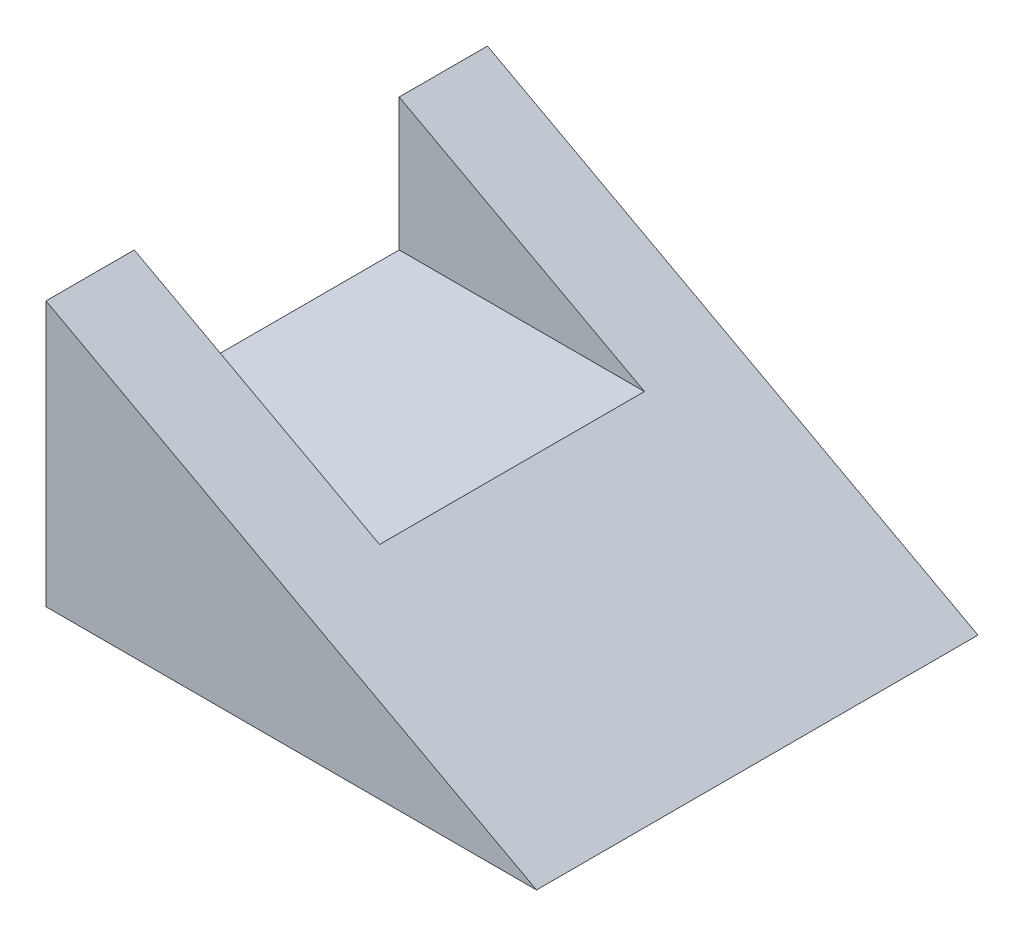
from build123d import *

# Parameters (mm, degrees)
EXTRUSION1_DEPTH        = 45
ESQUISSE2_W             = 27
ESQUISSE2_H             = 15.357142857
ENL_V_MAT_EXTRU_1_DEPTH = 73.484481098


with BuildPart() as part:
    # Esquisse1 → Extrusion1 (new body)
    with BuildSketch(Plane.XY):
        Polygon((0, 0), (0, 27), (50, 0), align=None)
    extrude(amount=EXTRUSION1_DEPTH)

    # Esquisse2 → Enl_v. mat.-Extru.1 (cut, through all)
    with BuildSketch(Plane.ZY):
        with Locations((22.5, 21.178571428)):
            Rectangle(ESQUISSE2_W, ESQUISSE2_H)
    extrude(amount=-ENL_V_MAT_EXTRU_1_DEPTH, mode=Mode.SUBTRACT)


solid = part.part
